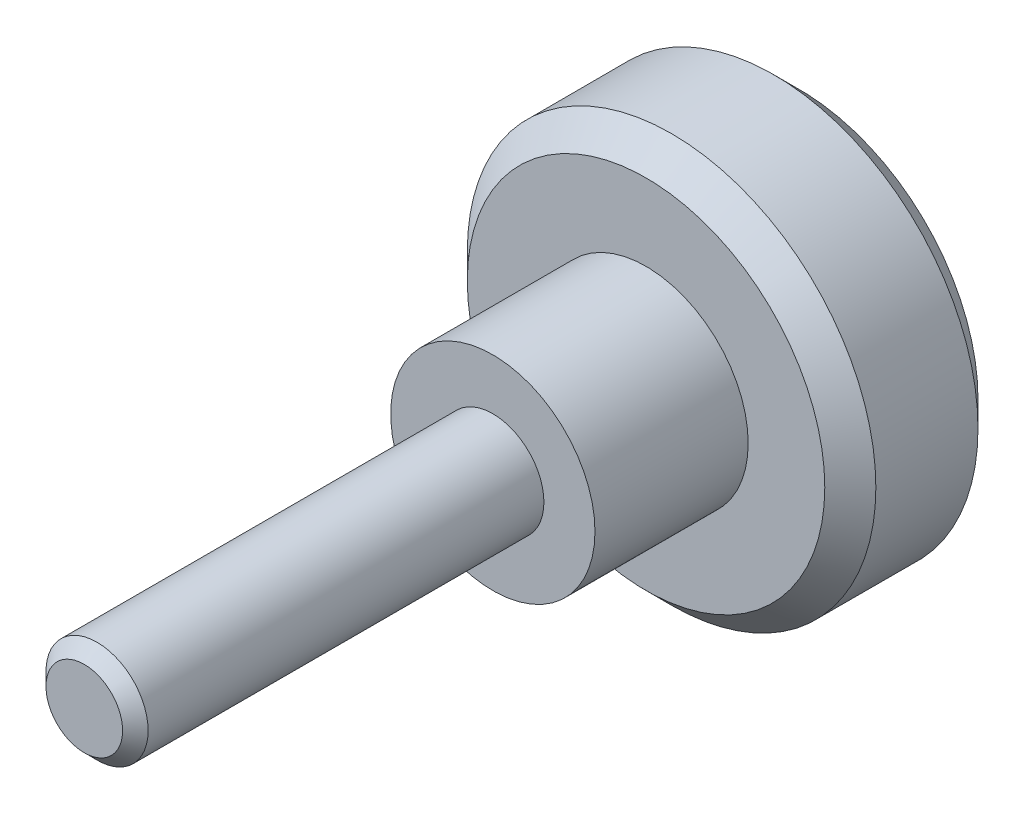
ISO-10303-21;
HEADER;
FILE_DESCRIPTION(('STEP AP214'),'2;1');
FILE_NAME('part.step','',(''),(''),'','','');
FILE_SCHEMA(('AUTOMOTIVE_DESIGN { 1 0 10303 214 1 1 1 1 }'));
ENDSEC;
DATA;
#1=APPLICATION_CONTEXT('core data for automotive mechanical design processes');
#2=APPLICATION_PROTOCOL_DEFINITION('international standard','automotive_design',2000,#1);
#3=PRODUCT_CONTEXT('',#1,'mechanical');
#4=PRODUCT('Part','Part','',(#3));
#5=PRODUCT_RELATED_PRODUCT_CATEGORY('part','',(#4));
#6=PRODUCT_DEFINITION_FORMATION('','',#4);
#7=PRODUCT_DEFINITION_CONTEXT('part definition',#1,'design');
#8=PRODUCT_DEFINITION('design','',#6,#7);
#9=PRODUCT_DEFINITION_SHAPE('','',#8);
#10=(LENGTH_UNIT() NAMED_UNIT(*) SI_UNIT(.MILLI.,.METRE.));
#11=(NAMED_UNIT(*) PLANE_ANGLE_UNIT() SI_UNIT($,.RADIAN.));
#12=(NAMED_UNIT(*) SI_UNIT($,.STERADIAN.) SOLID_ANGLE_UNIT());
#13=UNCERTAINTY_MEASURE_WITH_UNIT(LENGTH_MEASURE(1.E-05),#10,'distance_accuracy_value','');
#14=(GEOMETRIC_REPRESENTATION_CONTEXT(3) GLOBAL_UNCERTAINTY_ASSIGNED_CONTEXT((#13)) GLOBAL_UNIT_ASSIGNED_CONTEXT((#10,
#11,#12)) REPRESENTATION_CONTEXT('',''));
#15=CARTESIAN_POINT('',(0.,0.,0.));
#16=DIRECTION('',(0.,0.,1.));
#17=DIRECTION('',(1.,0.,0.));
#18=AXIS2_PLACEMENT_3D('',#15,#16,#17);
#19=CARTESIAN_POINT('',(7.,-7.,-6.));
#20=DIRECTION('',(0.,0.,-1.));
#21=DIRECTION('',(-1.,0.,0.));
#22=AXIS2_PLACEMENT_3D('',#19,#20,#21);
#23=PLANE('',#22);
#24=CARTESIAN_POINT('',(0.,0.,-6.));
#25=DIRECTION('',(0.,0.,1.));
#26=DIRECTION('',(1.,0.,0.));
#27=AXIS2_PLACEMENT_3D('',#24,#25,#26);
#28=CIRCLE('',#27,7.);
#29=CARTESIAN_POINT('',(7.,0.,-6.));
#30=VERTEX_POINT('',#29);
#31=EDGE_CURVE('E53',#30,#30,#28,.F.);
#32=ORIENTED_EDGE('',*,*,#31,.T.);
#33=EDGE_LOOP('',(#32));
#34=FACE_BOUND('',#33,.T.);
#35=ADVANCED_FACE('F15',(#34),#23,.T.);
#36=CARTESIAN_POINT('',(0.,0.,-6.));
#37=DIRECTION('',(0.,0.,1.));
#38=DIRECTION('',(1.,0.,0.));
#39=AXIS2_PLACEMENT_3D('',#36,#37,#38);
#40=CONICAL_SURFACE('',#39,7.,0.785398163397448);
#41=ORIENTED_EDGE('',*,*,#31,.F.);
#42=EDGE_LOOP('',(#41));
#43=FACE_BOUND('',#42,.T.);
#44=CARTESIAN_POINT('',(0.,0.,-5.));
#45=DIRECTION('',(0.,0.,1.));
#46=DIRECTION('',(1.,0.,0.));
#47=AXIS2_PLACEMENT_3D('',#44,#45,#46);
#48=CIRCLE('',#47,8.);
#49=CARTESIAN_POINT('',(8.,0.,-5.));
#50=VERTEX_POINT('',#49);
#51=EDGE_CURVE('E55',#50,#50,#48,.F.);
#52=ORIENTED_EDGE('',*,*,#51,.T.);
#53=EDGE_LOOP('',(#52));
#54=FACE_BOUND('',#53,.T.);
#55=ADVANCED_FACE('F90',(#43,#54),#40,.T.);
#56=CARTESIAN_POINT('',(0.,0.,-5.));
#57=DIRECTION('',(0.,0.,1.));
#58=DIRECTION('',(0.,-1.,0.));
#59=AXIS2_PLACEMENT_3D('',#56,#57,#58);
#60=CYLINDRICAL_SURFACE('',#59,8.);
#61=ORIENTED_EDGE('',*,*,#51,.F.);
#62=EDGE_LOOP('',(#61));
#63=FACE_BOUND('',#62,.T.);
#64=CARTESIAN_POINT('',(0.,0.,-1.));
#65=DIRECTION('',(0.,0.,1.));
#66=DIRECTION('',(1.,0.,0.));
#67=AXIS2_PLACEMENT_3D('',#64,#65,#66);
#68=CIRCLE('',#67,8.);
#69=CARTESIAN_POINT('',(8.,0.,-1.));
#70=VERTEX_POINT('',#69);
#71=EDGE_CURVE('E51',#70,#70,#68,.F.);
#72=ORIENTED_EDGE('',*,*,#71,.T.);
#73=EDGE_LOOP('',(#72));
#74=FACE_BOUND('',#73,.T.);
#75=ADVANCED_FACE('F106',(#63,#74),#60,.T.);
#76=CARTESIAN_POINT('',(0.,0.,-1.));
#77=DIRECTION('',(0.,0.,-1.));
#78=DIRECTION('',(-1.,0.,0.));
#79=AXIS2_PLACEMENT_3D('',#76,#77,#78);
#80=CONICAL_SURFACE('',#79,8.,0.785398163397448);
#81=ORIENTED_EDGE('',*,*,#71,.F.);
#82=EDGE_LOOP('',(#81));
#83=FACE_BOUND('',#82,.T.);
#84=CARTESIAN_POINT('',(0.,0.,0.));
#85=DIRECTION('',(0.,0.,-1.));
#86=DIRECTION('',(-1.,0.,0.));
#87=AXIS2_PLACEMENT_3D('',#84,#85,#86);
#88=CIRCLE('',#87,7.);
#89=CARTESIAN_POINT('',(-7.,0.,0.));
#90=VERTEX_POINT('',#89);
#91=EDGE_CURVE('E46',#90,#90,#88,.F.);
#92=ORIENTED_EDGE('',*,*,#91,.F.);
#93=EDGE_LOOP('',(#92));
#94=FACE_BOUND('',#93,.T.);
#95=ADVANCED_FACE('F94',(#83,#94),#80,.T.);
#96=CARTESIAN_POINT('',(-1.5,-1.5,22.));
#97=DIRECTION('',(0.,0.,1.));
#98=DIRECTION('',(1.,0.,0.));
#99=AXIS2_PLACEMENT_3D('',#96,#97,#98);
#100=PLANE('',#99);
#101=CARTESIAN_POINT('',(0.,0.,22.));
#102=DIRECTION('',(0.,0.,-1.));
#103=DIRECTION('',(0.,1.,0.));
#104=AXIS2_PLACEMENT_3D('',#101,#102,#103);
#105=CIRCLE('',#104,1.5);
#106=CARTESIAN_POINT('',(0.,1.5,22.));
#107=VERTEX_POINT('',#106);
#108=EDGE_CURVE('E41',#107,#107,#105,.F.);
#109=ORIENTED_EDGE('',*,*,#108,.T.);
#110=EDGE_LOOP('',(#109));
#111=FACE_BOUND('',#110,.T.);
#112=ADVANCED_FACE('F91',(#111),#100,.T.);
#113=CARTESIAN_POINT('',(-7.,-7.,0.));
#114=DIRECTION('',(0.,0.,1.));
#115=DIRECTION('',(1.,0.,0.));
#116=AXIS2_PLACEMENT_3D('',#113,#114,#115);
#117=PLANE('',#116);
#118=CARTESIAN_POINT('',(0.,0.,0.));
#119=DIRECTION('',(0.,0.,1.));
#120=DIRECTION('',(1.,0.,0.));
#121=AXIS2_PLACEMENT_3D('',#118,#119,#120);
#122=CIRCLE('',#121,4.);
#123=CARTESIAN_POINT('',(4.,0.,0.));
#124=VERTEX_POINT('',#123);
#125=EDGE_CURVE('E38',#124,#124,#122,.F.);
#126=ORIENTED_EDGE('',*,*,#125,.T.);
#127=EDGE_LOOP('',(#126));
#128=FACE_BOUND('',#127,.T.);
#129=ORIENTED_EDGE('',*,*,#91,.T.);
#130=EDGE_LOOP('',(#129));
#131=FACE_BOUND('',#130,.T.);
#132=ADVANCED_FACE('F93',(#128,#131),#117,.T.);
#133=CARTESIAN_POINT('',(0.,0.,21.5));
#134=DIRECTION('',(0.,0.,-1.));
#135=DIRECTION('',(0.,1.,0.));
#136=AXIS2_PLACEMENT_3D('',#133,#134,#135);
#137=CONICAL_SURFACE('',#136,2.,0.785398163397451);
#138=CARTESIAN_POINT('',(0.,0.,21.5));
#139=DIRECTION('',(0.,0.,1.));
#140=DIRECTION('',(1.,0.,0.));
#141=AXIS2_PLACEMENT_3D('',#138,#139,#140);
#142=CIRCLE('',#141,2.);
#143=CARTESIAN_POINT('',(2.,0.,21.5));
#144=VERTEX_POINT('',#143);
#145=EDGE_CURVE('E28',#144,#144,#142,.T.);
#146=ORIENTED_EDGE('',*,*,#145,.T.);
#147=EDGE_LOOP('',(#146));
#148=FACE_BOUND('',#147,.T.);
#149=ORIENTED_EDGE('',*,*,#108,.F.);
#150=EDGE_LOOP('',(#149));
#151=FACE_BOUND('',#150,.T.);
#152=ADVANCED_FACE('F71',(#148,#151),#137,.T.);
#153=CARTESIAN_POINT('',(0.,0.,0.));
#154=DIRECTION('',(0.,0.,1.));
#155=DIRECTION('',(1.,0.,0.));
#156=AXIS2_PLACEMENT_3D('',#153,#154,#155);
#157=CYLINDRICAL_SURFACE('',#156,4.);
#158=ORIENTED_EDGE('',*,*,#125,.F.);
#159=EDGE_LOOP('',(#158));
#160=FACE_BOUND('',#159,.T.);
#161=CARTESIAN_POINT('',(0.,0.,6.));
#162=DIRECTION('',(0.,0.,1.));
#163=DIRECTION('',(1.,0.,0.));
#164=AXIS2_PLACEMENT_3D('',#161,#162,#163);
#165=CIRCLE('',#164,4.);
#166=CARTESIAN_POINT('',(4.,0.,6.));
#167=VERTEX_POINT('',#166);
#168=EDGE_CURVE('E23',#167,#167,#165,.T.);
#169=ORIENTED_EDGE('',*,*,#168,.F.);
#170=EDGE_LOOP('',(#169));
#171=FACE_BOUND('',#170,.T.);
#172=ADVANCED_FACE('F76',(#160,#171),#157,.T.);
#173=CARTESIAN_POINT('',(0.,0.,6.));
#174=DIRECTION('',(0.,0.,1.));
#175=DIRECTION('',(1.,0.,0.));
#176=AXIS2_PLACEMENT_3D('',#173,#174,#175);
#177=CYLINDRICAL_SURFACE('',#176,2.);
#178=CARTESIAN_POINT('',(0.,0.,6.));
#179=DIRECTION('',(0.,0.,1.));
#180=DIRECTION('',(1.,0.,0.));
#181=AXIS2_PLACEMENT_3D('',#178,#179,#180);
#182=CIRCLE('',#181,2.);
#183=CARTESIAN_POINT('',(2.,0.,6.));
#184=VERTEX_POINT('',#183);
#185=EDGE_CURVE('E10',#184,#184,#182,.F.);
#186=ORIENTED_EDGE('',*,*,#185,.F.);
#187=EDGE_LOOP('',(#186));
#188=FACE_BOUND('',#187,.T.);
#189=ORIENTED_EDGE('',*,*,#145,.F.);
#190=EDGE_LOOP('',(#189));
#191=FACE_BOUND('',#190,.T.);
#192=ADVANCED_FACE('F74',(#188,#191),#177,.T.);
#193=CARTESIAN_POINT('',(-4.,-4.,6.));
#194=DIRECTION('',(0.,0.,1.));
#195=DIRECTION('',(1.,0.,0.));
#196=AXIS2_PLACEMENT_3D('',#193,#194,#195);
#197=PLANE('',#196);
#198=ORIENTED_EDGE('',*,*,#185,.T.);
#199=EDGE_LOOP('',(#198));
#200=FACE_BOUND('',#199,.T.);
#201=ORIENTED_EDGE('',*,*,#168,.T.);
#202=EDGE_LOOP('',(#201));
#203=FACE_BOUND('',#202,.T.);
#204=ADVANCED_FACE('F17',(#200,#203),#197,.T.);
#205=CLOSED_SHELL('',(#35,#55,#75,#95,#112,#132,#152,#172,#192,#204));
#206=MANIFOLD_SOLID_BREP('B1',#205);
#207=ADVANCED_BREP_SHAPE_REPRESENTATION('',(#18,#206),#14);
#208=SHAPE_DEFINITION_REPRESENTATION(#9,#207);
ENDSEC;
END-ISO-10303-21;
